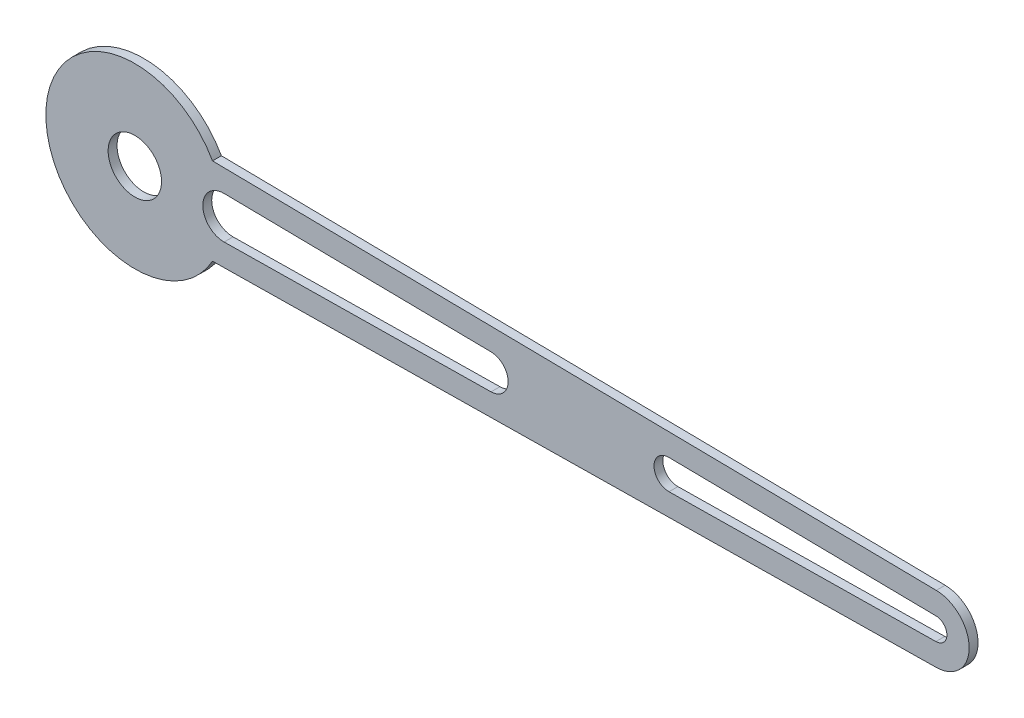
ISO-10303-21;
HEADER;
FILE_DESCRIPTION(('STEP AP214'),'2;1');
FILE_NAME('part.step','',(''),(''),'','','');
FILE_SCHEMA(('AUTOMOTIVE_DESIGN { 1 0 10303 214 1 1 1 1 }'));
ENDSEC;
DATA;
#1=APPLICATION_CONTEXT('core data for automotive mechanical design processes');
#2=APPLICATION_PROTOCOL_DEFINITION('international standard','automotive_design',2000,#1);
#3=PRODUCT_CONTEXT('',#1,'mechanical');
#4=PRODUCT('Part','Part','',(#3));
#5=PRODUCT_RELATED_PRODUCT_CATEGORY('part','',(#4));
#6=PRODUCT_DEFINITION_FORMATION('','',#4);
#7=PRODUCT_DEFINITION_CONTEXT('part definition',#1,'design');
#8=PRODUCT_DEFINITION('design','',#6,#7);
#9=PRODUCT_DEFINITION_SHAPE('','',#8);
#10=(LENGTH_UNIT() NAMED_UNIT(*) SI_UNIT(.MILLI.,.METRE.));
#11=(NAMED_UNIT(*) PLANE_ANGLE_UNIT() SI_UNIT($,.RADIAN.));
#12=(NAMED_UNIT(*) SI_UNIT($,.STERADIAN.) SOLID_ANGLE_UNIT());
#13=UNCERTAINTY_MEASURE_WITH_UNIT(LENGTH_MEASURE(1.E-05),#10,'distance_accuracy_value','');
#14=(GEOMETRIC_REPRESENTATION_CONTEXT(3) GLOBAL_UNCERTAINTY_ASSIGNED_CONTEXT((#13)) GLOBAL_UNIT_ASSIGNED_CONTEXT((#10,
#11,#12)) REPRESENTATION_CONTEXT('',''));
#15=CARTESIAN_POINT('',(0.,0.,0.));
#16=DIRECTION('',(0.,0.,1.));
#17=DIRECTION('',(1.,0.,0.));
#18=AXIS2_PLACEMENT_3D('',#15,#16,#17);
#19=CARTESIAN_POINT('',(9.,0.,0.1));
#20=DIRECTION('',(0.,0.,1.));
#21=DIRECTION('',(1.,0.,0.));
#22=AXIS2_PLACEMENT_3D('',#19,#20,#21);
#23=PLANE('',#22);
#24=DIRECTION('',(-0.999903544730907,0.0138888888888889,0.));
#25=VECTOR('',#24,1.);
#26=CARTESIAN_POINT('',(6.00231481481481,0.166650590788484,0.1));
#27=LINE('',#26,#25);
#28=CARTESIAN_POINT('',(9.00173611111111,0.124987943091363,0.1));
#29=VERTEX_POINT('',#28);
#30=CARTESIAN_POINT('',(6.00231481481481,0.166650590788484,0.1));
#31=VERTEX_POINT('',#30);
#32=EDGE_CURVE('E140',#29,#31,#27,.T.);
#33=ORIENTED_EDGE('',*,*,#32,.F.);
#34=CARTESIAN_POINT('',(9.,0.,0.1));
#35=DIRECTION('',(0.,0.,1.));
#36=DIRECTION('',(1.,0.,0.));
#37=AXIS2_PLACEMENT_3D('',#34,#35,#36);
#38=CIRCLE('',#37,0.125);
#39=CARTESIAN_POINT('',(9.00173611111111,-0.124987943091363,0.1));
#40=VERTEX_POINT('',#39);
#41=EDGE_CURVE('E128',#40,#29,#38,.T.);
#42=ORIENTED_EDGE('',*,*,#41,.F.);
#43=DIRECTION('',(0.999903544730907,0.0138888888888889,0.));
#44=VECTOR('',#43,1.);
#45=CARTESIAN_POINT('',(6.00231481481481,-0.166650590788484,0.1));
#46=LINE('',#45,#44);
#47=CARTESIAN_POINT('',(6.00231481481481,-0.166650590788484,0.1));
#48=VERTEX_POINT('',#47);
#49=EDGE_CURVE('E153',#48,#40,#46,.T.);
#50=ORIENTED_EDGE('',*,*,#49,.F.);
#51=CARTESIAN_POINT('',(6.,0.,0.1));
#52=DIRECTION('',(0.,0.,1.));
#53=DIRECTION('',(1.,0.,0.));
#54=AXIS2_PLACEMENT_3D('',#51,#52,#53);
#55=CIRCLE('',#54,0.166666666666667);
#56=EDGE_CURVE('E151',#31,#48,#55,.T.);
#57=ORIENTED_EDGE('',*,*,#56,.F.);
#58=EDGE_LOOP('',(#33,#42,#50,#57));
#59=FACE_BOUND('',#58,.T.);
#60=CARTESIAN_POINT('',(9.,0.,0.1));
#61=DIRECTION('',(0.,0.,1.));
#62=DIRECTION('',(1.,0.,0.));
#63=AXIS2_PLACEMENT_3D('',#60,#61,#62);
#64=CIRCLE('',#63,0.375);
#65=CARTESIAN_POINT('',(9.00520833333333,-0.37496382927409,0.1));
#66=VERTEX_POINT('',#65);
#67=CARTESIAN_POINT('',(9.00520833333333,0.37496382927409,0.1));
#68=VERTEX_POINT('',#67);
#69=EDGE_CURVE('E199',#66,#68,#64,.T.);
#70=ORIENTED_EDGE('',*,*,#69,.T.);
#71=DIRECTION('',(-0.999903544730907,0.0138888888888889,0.));
#72=VECTOR('',#71,1.);
#73=CARTESIAN_POINT('',(0.872886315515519,0.487923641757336,0.1));
#74=LINE('',#73,#72);
#75=CARTESIAN_POINT('',(0.872886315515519,0.487923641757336,0.1));
#76=VERTEX_POINT('',#75);
#77=EDGE_CURVE('E201',#68,#76,#74,.T.);
#78=ORIENTED_EDGE('',*,*,#77,.T.);
#79=CARTESIAN_POINT('',(0.,0.,0.1));
#80=DIRECTION('',(0.,0.,1.));
#81=DIRECTION('',(1.,0.,0.));
#82=AXIS2_PLACEMENT_3D('',#79,#80,#81);
#83=CIRCLE('',#82,1.);
#84=CARTESIAN_POINT('',(0.872886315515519,-0.487923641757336,0.1));
#85=VERTEX_POINT('',#84);
#86=EDGE_CURVE('E206',#76,#85,#83,.T.);
#87=ORIENTED_EDGE('',*,*,#86,.T.);
#88=DIRECTION('',(0.999903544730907,0.0138888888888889,0.));
#89=VECTOR('',#88,1.);
#90=CARTESIAN_POINT('',(0.872886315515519,-0.487923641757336,0.1));
#91=LINE('',#90,#89);
#92=EDGE_CURVE('E208',#85,#66,#91,.T.);
#93=ORIENTED_EDGE('',*,*,#92,.T.);
#94=EDGE_LOOP('',(#70,#78,#87,#93));
#95=FACE_BOUND('',#94,.T.);
#96=DIRECTION('',(0.999903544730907,0.0138888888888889,0.));
#97=VECTOR('',#96,1.);
#98=CARTESIAN_POINT('',(1.00327932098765,-0.236088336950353,0.1));
#99=LINE('',#98,#97);
#100=CARTESIAN_POINT('',(1.00327932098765,-0.236088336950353,0.1));
#101=VERTEX_POINT('',#100);
#102=CARTESIAN_POINT('',(4.00270061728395,-0.194425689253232,0.1));
#103=VERTEX_POINT('',#102);
#104=EDGE_CURVE('E174',#101,#103,#99,.T.);
#105=ORIENTED_EDGE('',*,*,#104,.F.);
#106=CARTESIAN_POINT('',(1.,0.,0.1));
#107=DIRECTION('',(0.,0.,1.));
#108=DIRECTION('',(1.,0.,0.));
#109=AXIS2_PLACEMENT_3D('',#106,#107,#108);
#110=CIRCLE('',#109,0.236111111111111);
#111=CARTESIAN_POINT('',(1.00327932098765,0.236088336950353,0.1));
#112=VERTEX_POINT('',#111);
#113=EDGE_CURVE('E166',#112,#101,#110,.T.);
#114=ORIENTED_EDGE('',*,*,#113,.F.);
#115=DIRECTION('',(-0.999903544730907,0.0138888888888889,0.));
#116=VECTOR('',#115,1.);
#117=CARTESIAN_POINT('',(1.00327932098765,0.236088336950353,0.1));
#118=LINE('',#117,#116);
#119=CARTESIAN_POINT('',(4.00270061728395,0.194425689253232,0.1));
#120=VERTEX_POINT('',#119);
#121=EDGE_CURVE('E176',#120,#112,#118,.T.);
#122=ORIENTED_EDGE('',*,*,#121,.F.);
#123=CARTESIAN_POINT('',(4.,0.,0.1));
#124=DIRECTION('',(0.,0.,1.));
#125=DIRECTION('',(1.,0.,0.));
#126=AXIS2_PLACEMENT_3D('',#123,#124,#125);
#127=CIRCLE('',#126,0.194444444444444);
#128=EDGE_CURVE('E173',#103,#120,#127,.T.);
#129=ORIENTED_EDGE('',*,*,#128,.F.);
#130=EDGE_LOOP('',(#105,#114,#122,#129));
#131=FACE_BOUND('',#130,.T.);
#132=CARTESIAN_POINT('',(0.,0.,0.1));
#133=DIRECTION('',(0.,0.,1.));
#134=DIRECTION('',(1.,0.,0.));
#135=AXIS2_PLACEMENT_3D('',#132,#133,#134);
#136=CIRCLE('',#135,0.3);
#137=CARTESIAN_POINT('',(0.3,0.,0.1));
#138=VERTEX_POINT('',#137);
#139=EDGE_CURVE('E157',#138,#138,#136,.T.);
#140=ORIENTED_EDGE('',*,*,#139,.F.);
#141=EDGE_LOOP('',(#140));
#142=FACE_BOUND('',#141,.T.);
#143=ADVANCED_FACE('F41',(#59,#95,#131,#142),#23,.T.);
#144=CARTESIAN_POINT('',(9.,0.,0.));
#145=DIRECTION('',(0.,0.,1.));
#146=DIRECTION('',(1.,0.,0.));
#147=AXIS2_PLACEMENT_3D('',#144,#145,#146);
#148=PLANE('',#147);
#149=CARTESIAN_POINT('',(9.,0.,0.));
#150=DIRECTION('',(0.,0.,1.));
#151=DIRECTION('',(1.,0.,0.));
#152=AXIS2_PLACEMENT_3D('',#149,#150,#151);
#153=CIRCLE('',#152,0.125);
#154=CARTESIAN_POINT('',(9.00173611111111,-0.124987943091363,0.));
#155=VERTEX_POINT('',#154);
#156=CARTESIAN_POINT('',(9.00173611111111,0.124987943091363,0.));
#157=VERTEX_POINT('',#156);
#158=EDGE_CURVE('E63',#155,#157,#153,.T.);
#159=ORIENTED_EDGE('',*,*,#158,.T.);
#160=DIRECTION('',(-0.999903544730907,0.0138888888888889,0.));
#161=VECTOR('',#160,1.);
#162=CARTESIAN_POINT('',(6.00231481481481,0.166650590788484,0.));
#163=LINE('',#162,#161);
#164=CARTESIAN_POINT('',(6.00231481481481,0.166650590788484,0.));
#165=VERTEX_POINT('',#164);
#166=EDGE_CURVE('E144',#157,#165,#163,.T.);
#167=ORIENTED_EDGE('',*,*,#166,.T.);
#168=CARTESIAN_POINT('',(6.,0.,0.));
#169=DIRECTION('',(0.,0.,1.));
#170=DIRECTION('',(1.,0.,0.));
#171=AXIS2_PLACEMENT_3D('',#168,#169,#170);
#172=CIRCLE('',#171,0.166666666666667);
#173=CARTESIAN_POINT('',(6.00231481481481,-0.166650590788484,0.));
#174=VERTEX_POINT('',#173);
#175=EDGE_CURVE('E161',#165,#174,#172,.T.);
#176=ORIENTED_EDGE('',*,*,#175,.T.);
#177=DIRECTION('',(0.999903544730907,0.0138888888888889,0.));
#178=VECTOR('',#177,1.);
#179=CARTESIAN_POINT('',(6.00231481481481,-0.166650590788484,0.));
#180=LINE('',#179,#178);
#181=EDGE_CURVE('E138',#174,#155,#180,.T.);
#182=ORIENTED_EDGE('',*,*,#181,.T.);
#183=EDGE_LOOP('',(#159,#167,#176,#182));
#184=FACE_BOUND('',#183,.T.);
#185=CARTESIAN_POINT('',(9.,0.,0.));
#186=DIRECTION('',(0.,0.,1.));
#187=DIRECTION('',(1.,0.,0.));
#188=AXIS2_PLACEMENT_3D('',#185,#186,#187);
#189=CIRCLE('',#188,0.375);
#190=CARTESIAN_POINT('',(9.00520833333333,-0.37496382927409,0.));
#191=VERTEX_POINT('',#190);
#192=CARTESIAN_POINT('',(9.00520833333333,0.37496382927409,0.));
#193=VERTEX_POINT('',#192);
#194=EDGE_CURVE('E200',#191,#193,#189,.T.);
#195=ORIENTED_EDGE('',*,*,#194,.F.);
#196=DIRECTION('',(0.999903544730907,0.0138888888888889,0.));
#197=VECTOR('',#196,1.);
#198=CARTESIAN_POINT('',(0.872886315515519,-0.487923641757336,0.));
#199=LINE('',#198,#197);
#200=CARTESIAN_POINT('',(0.872886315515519,-0.487923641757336,0.));
#201=VERTEX_POINT('',#200);
#202=EDGE_CURVE('E204',#201,#191,#199,.T.);
#203=ORIENTED_EDGE('',*,*,#202,.F.);
#204=CARTESIAN_POINT('',(0.,0.,0.));
#205=DIRECTION('',(0.,0.,1.));
#206=DIRECTION('',(1.,0.,0.));
#207=AXIS2_PLACEMENT_3D('',#204,#205,#206);
#208=CIRCLE('',#207,1.);
#209=CARTESIAN_POINT('',(0.872886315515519,0.487923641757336,0.));
#210=VERTEX_POINT('',#209);
#211=EDGE_CURVE('E214',#210,#201,#208,.T.);
#212=ORIENTED_EDGE('',*,*,#211,.F.);
#213=DIRECTION('',(-0.999903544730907,0.0138888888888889,0.));
#214=VECTOR('',#213,1.);
#215=CARTESIAN_POINT('',(0.872886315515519,0.487923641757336,0.));
#216=LINE('',#215,#214);
#217=EDGE_CURVE('E213',#193,#210,#216,.T.);
#218=ORIENTED_EDGE('',*,*,#217,.F.);
#219=EDGE_LOOP('',(#195,#203,#212,#218));
#220=FACE_BOUND('',#219,.T.);
#221=CARTESIAN_POINT('',(1.,0.,0.));
#222=DIRECTION('',(0.,0.,1.));
#223=DIRECTION('',(1.,0.,0.));
#224=AXIS2_PLACEMENT_3D('',#221,#222,#223);
#225=CIRCLE('',#224,0.236111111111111);
#226=CARTESIAN_POINT('',(1.00327932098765,0.236088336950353,0.));
#227=VERTEX_POINT('',#226);
#228=CARTESIAN_POINT('',(1.00327932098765,-0.236088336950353,0.));
#229=VERTEX_POINT('',#228);
#230=EDGE_CURVE('E148',#227,#229,#225,.T.);
#231=ORIENTED_EDGE('',*,*,#230,.T.);
#232=DIRECTION('',(0.999903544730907,0.0138888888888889,0.));
#233=VECTOR('',#232,1.);
#234=CARTESIAN_POINT('',(1.00327932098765,-0.236088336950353,0.));
#235=LINE('',#234,#233);
#236=CARTESIAN_POINT('',(4.00270061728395,-0.194425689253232,0.));
#237=VERTEX_POINT('',#236);
#238=EDGE_CURVE('E185',#229,#237,#235,.T.);
#239=ORIENTED_EDGE('',*,*,#238,.T.);
#240=CARTESIAN_POINT('',(4.,0.,0.));
#241=DIRECTION('',(0.,0.,1.));
#242=DIRECTION('',(1.,0.,0.));
#243=AXIS2_PLACEMENT_3D('',#240,#241,#242);
#244=CIRCLE('',#243,0.194444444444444);
#245=CARTESIAN_POINT('',(4.00270061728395,0.194425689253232,0.));
#246=VERTEX_POINT('',#245);
#247=EDGE_CURVE('E183',#237,#246,#244,.T.);
#248=ORIENTED_EDGE('',*,*,#247,.T.);
#249=DIRECTION('',(-0.999903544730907,0.0138888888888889,0.));
#250=VECTOR('',#249,1.);
#251=CARTESIAN_POINT('',(1.00327932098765,0.236088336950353,0.));
#252=LINE('',#251,#250);
#253=EDGE_CURVE('E171',#246,#227,#252,.T.);
#254=ORIENTED_EDGE('',*,*,#253,.T.);
#255=EDGE_LOOP('',(#231,#239,#248,#254));
#256=FACE_BOUND('',#255,.T.);
#257=CARTESIAN_POINT('',(0.,0.,0.));
#258=DIRECTION('',(0.,0.,1.));
#259=DIRECTION('',(1.,0.,0.));
#260=AXIS2_PLACEMENT_3D('',#257,#258,#259);
#261=CIRCLE('',#260,0.3);
#262=CARTESIAN_POINT('',(0.3,0.,0.));
#263=VERTEX_POINT('',#262);
#264=EDGE_CURVE('E288',#263,#263,#261,.T.);
#265=ORIENTED_EDGE('',*,*,#264,.T.);
#266=EDGE_LOOP('',(#265));
#267=FACE_BOUND('',#266,.T.);
#268=ADVANCED_FACE('F235',(#184,#220,#256,#267),#148,.F.);
#269=CARTESIAN_POINT('',(9.,0.,0.1));
#270=DIRECTION('',(0.,0.,-1.));
#271=DIRECTION('',(-1.,0.,0.));
#272=AXIS2_PLACEMENT_3D('',#269,#270,#271);
#273=CYLINDRICAL_SURFACE('',#272,0.375);
#274=ORIENTED_EDGE('',*,*,#194,.T.);
#275=DIRECTION('',(0.,0.,-1.));
#276=VECTOR('',#275,1.);
#277=CARTESIAN_POINT('',(9.00520833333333,0.37496382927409,0.1));
#278=LINE('',#277,#276);
#279=EDGE_CURVE('E11',#68,#193,#278,.T.);
#280=ORIENTED_EDGE('',*,*,#279,.F.);
#281=ORIENTED_EDGE('',*,*,#69,.F.);
#282=DIRECTION('',(0.,0.,-1.));
#283=VECTOR('',#282,1.);
#284=CARTESIAN_POINT('',(9.00520833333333,-0.37496382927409,0.1));
#285=LINE('',#284,#283);
#286=EDGE_CURVE('E209',#66,#191,#285,.T.);
#287=ORIENTED_EDGE('',*,*,#286,.T.);
#288=EDGE_LOOP('',(#274,#280,#281,#287));
#289=FACE_BOUND('',#288,.T.);
#290=ADVANCED_FACE('F43',(#289),#273,.T.);
#291=CARTESIAN_POINT('',(0.872886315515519,0.487923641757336,0.1));
#292=DIRECTION('',(-0.0138888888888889,-0.999903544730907,0.));
#293=DIRECTION('',(0.999903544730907,-0.0138888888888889,0.));
#294=AXIS2_PLACEMENT_3D('',#291,#292,#293);
#295=PLANE('',#294);
#296=ORIENTED_EDGE('',*,*,#217,.T.);
#297=DIRECTION('',(0.,0.,-1.));
#298=VECTOR('',#297,1.);
#299=CARTESIAN_POINT('',(0.872886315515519,0.487923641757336,0.1));
#300=LINE('',#299,#298);
#301=EDGE_CURVE('E47',#76,#210,#300,.T.);
#302=ORIENTED_EDGE('',*,*,#301,.F.);
#303=ORIENTED_EDGE('',*,*,#77,.F.);
#304=ORIENTED_EDGE('',*,*,#279,.T.);
#305=EDGE_LOOP('',(#296,#302,#303,#304));
#306=FACE_BOUND('',#305,.T.);
#307=ADVANCED_FACE('F244',(#306),#295,.F.);
#308=CARTESIAN_POINT('',(0.,0.,0.1));
#309=DIRECTION('',(0.,0.,-1.));
#310=DIRECTION('',(-1.,0.,0.));
#311=AXIS2_PLACEMENT_3D('',#308,#309,#310);
#312=CYLINDRICAL_SURFACE('',#311,1.);
#313=ORIENTED_EDGE('',*,*,#211,.T.);
#314=DIRECTION('',(0.,0.,-1.));
#315=VECTOR('',#314,1.);
#316=CARTESIAN_POINT('',(0.872886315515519,-0.487923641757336,0.1));
#317=LINE('',#316,#315);
#318=EDGE_CURVE('E219',#85,#201,#317,.T.);
#319=ORIENTED_EDGE('',*,*,#318,.F.);
#320=ORIENTED_EDGE('',*,*,#86,.F.);
#321=ORIENTED_EDGE('',*,*,#301,.T.);
#322=EDGE_LOOP('',(#313,#319,#320,#321));
#323=FACE_BOUND('',#322,.T.);
#324=ADVANCED_FACE('F226',(#323),#312,.T.);
#325=CARTESIAN_POINT('',(0.872886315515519,-0.487923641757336,0.1));
#326=DIRECTION('',(-0.0138888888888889,0.999903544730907,0.));
#327=DIRECTION('',(-0.999903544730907,-0.0138888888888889,0.));
#328=AXIS2_PLACEMENT_3D('',#325,#326,#327);
#329=PLANE('',#328);
#330=ORIENTED_EDGE('',*,*,#202,.T.);
#331=ORIENTED_EDGE('',*,*,#286,.F.);
#332=ORIENTED_EDGE('',*,*,#92,.F.);
#333=ORIENTED_EDGE('',*,*,#318,.T.);
#334=EDGE_LOOP('',(#330,#331,#332,#333));
#335=FACE_BOUND('',#334,.T.);
#336=ADVANCED_FACE('F240',(#335),#329,.F.);
#337=CARTESIAN_POINT('',(1.,0.,0.1));
#338=DIRECTION('',(0.,0.,-1.));
#339=DIRECTION('',(-1.,0.,0.));
#340=AXIS2_PLACEMENT_3D('',#337,#338,#339);
#341=CYLINDRICAL_SURFACE('',#340,0.236111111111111);
#342=ORIENTED_EDGE('',*,*,#230,.F.);
#343=DIRECTION('',(0.,0.,-1.));
#344=VECTOR('',#343,1.);
#345=CARTESIAN_POINT('',(1.00327932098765,0.236088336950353,0.1));
#346=LINE('',#345,#344);
#347=EDGE_CURVE('E178',#112,#227,#346,.T.);
#348=ORIENTED_EDGE('',*,*,#347,.F.);
#349=ORIENTED_EDGE('',*,*,#113,.T.);
#350=DIRECTION('',(0.,0.,-1.));
#351=VECTOR('',#350,1.);
#352=CARTESIAN_POINT('',(1.00327932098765,-0.236088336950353,0.1));
#353=LINE('',#352,#351);
#354=EDGE_CURVE('E198',#101,#229,#353,.T.);
#355=ORIENTED_EDGE('',*,*,#354,.T.);
#356=EDGE_LOOP('',(#342,#348,#349,#355));
#357=FACE_BOUND('',#356,.T.);
#358=ADVANCED_FACE('F256',(#357),#341,.F.);
#359=CARTESIAN_POINT('',(1.00327932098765,-0.236088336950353,0.1));
#360=DIRECTION('',(-0.0138888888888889,0.999903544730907,0.));
#361=DIRECTION('',(-0.999903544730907,-0.0138888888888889,0.));
#362=AXIS2_PLACEMENT_3D('',#359,#360,#361);
#363=PLANE('',#362);
#364=ORIENTED_EDGE('',*,*,#238,.F.);
#365=ORIENTED_EDGE('',*,*,#354,.F.);
#366=ORIENTED_EDGE('',*,*,#104,.T.);
#367=DIRECTION('',(0.,0.,-1.));
#368=VECTOR('',#367,1.);
#369=CARTESIAN_POINT('',(4.00270061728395,-0.194425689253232,0.1));
#370=LINE('',#369,#368);
#371=EDGE_CURVE('E193',#103,#237,#370,.T.);
#372=ORIENTED_EDGE('',*,*,#371,.T.);
#373=EDGE_LOOP('',(#364,#365,#366,#372));
#374=FACE_BOUND('',#373,.T.);
#375=ADVANCED_FACE('F264',(#374),#363,.T.);
#376=CARTESIAN_POINT('',(4.,0.,0.1));
#377=DIRECTION('',(0.,0.,-1.));
#378=DIRECTION('',(-1.,0.,0.));
#379=AXIS2_PLACEMENT_3D('',#376,#377,#378);
#380=CYLINDRICAL_SURFACE('',#379,0.194444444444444);
#381=ORIENTED_EDGE('',*,*,#247,.F.);
#382=ORIENTED_EDGE('',*,*,#371,.F.);
#383=ORIENTED_EDGE('',*,*,#128,.T.);
#384=DIRECTION('',(0.,0.,-1.));
#385=VECTOR('',#384,1.);
#386=CARTESIAN_POINT('',(4.00270061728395,0.194425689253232,0.1));
#387=LINE('',#386,#385);
#388=EDGE_CURVE('E191',#120,#246,#387,.T.);
#389=ORIENTED_EDGE('',*,*,#388,.T.);
#390=EDGE_LOOP('',(#381,#382,#383,#389));
#391=FACE_BOUND('',#390,.T.);
#392=ADVANCED_FACE('F269',(#391),#380,.F.);
#393=CARTESIAN_POINT('',(1.00327932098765,0.236088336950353,0.1));
#394=DIRECTION('',(-0.0138888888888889,-0.999903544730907,0.));
#395=DIRECTION('',(0.999903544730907,-0.0138888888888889,0.));
#396=AXIS2_PLACEMENT_3D('',#393,#394,#395);
#397=PLANE('',#396);
#398=ORIENTED_EDGE('',*,*,#253,.F.);
#399=ORIENTED_EDGE('',*,*,#388,.F.);
#400=ORIENTED_EDGE('',*,*,#121,.T.);
#401=ORIENTED_EDGE('',*,*,#347,.T.);
#402=EDGE_LOOP('',(#398,#399,#400,#401));
#403=FACE_BOUND('',#402,.T.);
#404=ADVANCED_FACE('F280',(#403),#397,.T.);
#405=CARTESIAN_POINT('',(9.,0.,0.1));
#406=DIRECTION('',(0.,0.,-1.));
#407=DIRECTION('',(-1.,0.,0.));
#408=AXIS2_PLACEMENT_3D('',#405,#406,#407);
#409=CYLINDRICAL_SURFACE('',#408,0.125);
#410=ORIENTED_EDGE('',*,*,#158,.F.);
#411=DIRECTION('',(0.,0.,-1.));
#412=VECTOR('',#411,1.);
#413=CARTESIAN_POINT('',(9.00173611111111,-0.124987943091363,0.1));
#414=LINE('',#413,#412);
#415=EDGE_CURVE('E131',#40,#155,#414,.T.);
#416=ORIENTED_EDGE('',*,*,#415,.F.);
#417=ORIENTED_EDGE('',*,*,#41,.T.);
#418=DIRECTION('',(0.,0.,-1.));
#419=VECTOR('',#418,1.);
#420=CARTESIAN_POINT('',(9.00173611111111,0.124987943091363,0.1));
#421=LINE('',#420,#419);
#422=EDGE_CURVE('E134',#29,#157,#421,.T.);
#423=ORIENTED_EDGE('',*,*,#422,.T.);
#424=EDGE_LOOP('',(#410,#416,#417,#423));
#425=FACE_BOUND('',#424,.T.);
#426=ADVANCED_FACE('F135',(#425),#409,.F.);
#427=CARTESIAN_POINT('',(6.00231481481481,0.166650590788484,0.1));
#428=DIRECTION('',(-0.0138888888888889,-0.999903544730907,0.));
#429=DIRECTION('',(0.999903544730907,-0.0138888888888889,0.));
#430=AXIS2_PLACEMENT_3D('',#427,#428,#429);
#431=PLANE('',#430);
#432=ORIENTED_EDGE('',*,*,#166,.F.);
#433=ORIENTED_EDGE('',*,*,#422,.F.);
#434=ORIENTED_EDGE('',*,*,#32,.T.);
#435=DIRECTION('',(0.,0.,-1.));
#436=VECTOR('',#435,1.);
#437=CARTESIAN_POINT('',(6.00231481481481,0.166650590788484,0.1));
#438=LINE('',#437,#436);
#439=EDGE_CURVE('E150',#31,#165,#438,.T.);
#440=ORIENTED_EDGE('',*,*,#439,.T.);
#441=EDGE_LOOP('',(#432,#433,#434,#440));
#442=FACE_BOUND('',#441,.T.);
#443=ADVANCED_FACE('F142',(#442),#431,.T.);
#444=CARTESIAN_POINT('',(6.,0.,0.1));
#445=DIRECTION('',(0.,0.,-1.));
#446=DIRECTION('',(-1.,0.,0.));
#447=AXIS2_PLACEMENT_3D('',#444,#445,#446);
#448=CYLINDRICAL_SURFACE('',#447,0.166666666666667);
#449=ORIENTED_EDGE('',*,*,#175,.F.);
#450=ORIENTED_EDGE('',*,*,#439,.F.);
#451=ORIENTED_EDGE('',*,*,#56,.T.);
#452=DIRECTION('',(0.,0.,-1.));
#453=VECTOR('',#452,1.);
#454=CARTESIAN_POINT('',(6.00231481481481,-0.166650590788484,0.1));
#455=LINE('',#454,#453);
#456=EDGE_CURVE('E57',#48,#174,#455,.T.);
#457=ORIENTED_EDGE('',*,*,#456,.T.);
#458=EDGE_LOOP('',(#449,#450,#451,#457));
#459=FACE_BOUND('',#458,.T.);
#460=ADVANCED_FACE('F304',(#459),#448,.F.);
#461=CARTESIAN_POINT('',(6.00231481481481,-0.166650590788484,0.1));
#462=DIRECTION('',(-0.0138888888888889,0.999903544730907,0.));
#463=DIRECTION('',(-0.999903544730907,-0.0138888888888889,0.));
#464=AXIS2_PLACEMENT_3D('',#461,#462,#463);
#465=PLANE('',#464);
#466=ORIENTED_EDGE('',*,*,#181,.F.);
#467=ORIENTED_EDGE('',*,*,#456,.F.);
#468=ORIENTED_EDGE('',*,*,#49,.T.);
#469=ORIENTED_EDGE('',*,*,#415,.T.);
#470=EDGE_LOOP('',(#466,#467,#468,#469));
#471=FACE_BOUND('',#470,.T.);
#472=ADVANCED_FACE('F297',(#471),#465,.T.);
#473=CARTESIAN_POINT('',(0.,0.,0.1));
#474=DIRECTION('',(0.,0.,-1.));
#475=DIRECTION('',(-1.,0.,0.));
#476=AXIS2_PLACEMENT_3D('',#473,#474,#475);
#477=CYLINDRICAL_SURFACE('',#476,0.3);
#478=ORIENTED_EDGE('',*,*,#139,.T.);
#479=EDGE_LOOP('',(#478));
#480=FACE_BOUND('',#479,.T.);
#481=ORIENTED_EDGE('',*,*,#264,.F.);
#482=EDGE_LOOP('',(#481));
#483=FACE_BOUND('',#482,.T.);
#484=ADVANCED_FACE('F294',(#480,#483),#477,.F.);
#485=CLOSED_SHELL('',(#143,#268,#290,#307,#324,#336,#358,#375,#392,#404,#426,#443,#460,#472,#484));
#486=MANIFOLD_SOLID_BREP('B2',#485);
#487=ADVANCED_BREP_SHAPE_REPRESENTATION('',(#18,#486),#14);
#488=SHAPE_DEFINITION_REPRESENTATION(#9,#487);
ENDSEC;
END-ISO-10303-21;
